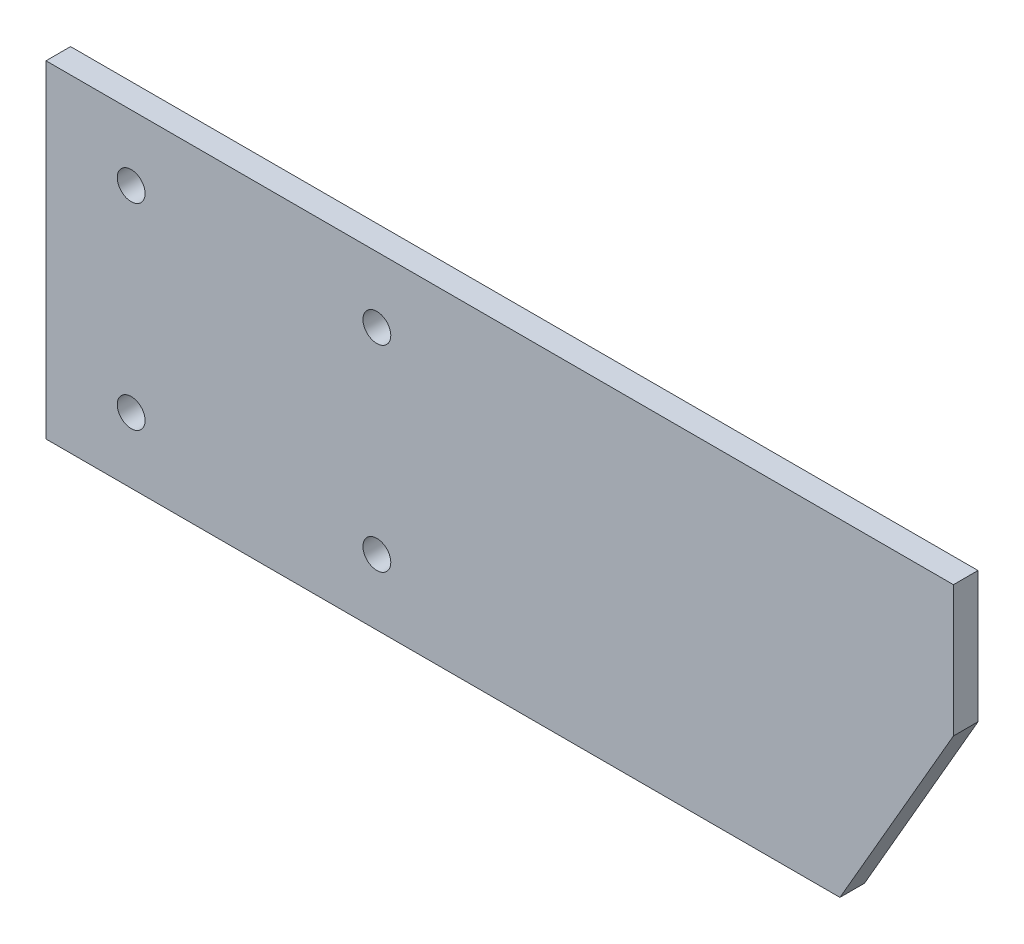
from build123d import *

# Parameters (mm, degrees)
SKETCH1_R      = 8.5
EXTRUDE1_DEPTH = 15


with BuildPart() as part:
    # Sketch1 → Extrude1 (new body)
    with BuildSketch(Plane.XY):
        Polygon((-127, 100), (427, 100), (427, 20), (357.717967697, -100), (-127, -100), align=None)
        with Locations((-75, 60)):
            Circle(SKETCH1_R, mode=Mode.SUBTRACT)
        with Locations((75, 60)):
            Circle(SKETCH1_R, mode=Mode.SUBTRACT)
        with Locations((75, -60)):
            Circle(SKETCH1_R, mode=Mode.SUBTRACT)
        with Locations((-75, -60)):
            Circle(SKETCH1_R, mode=Mode.SUBTRACT)
    extrude(amount=EXTRUDE1_DEPTH)


solid = part.part
